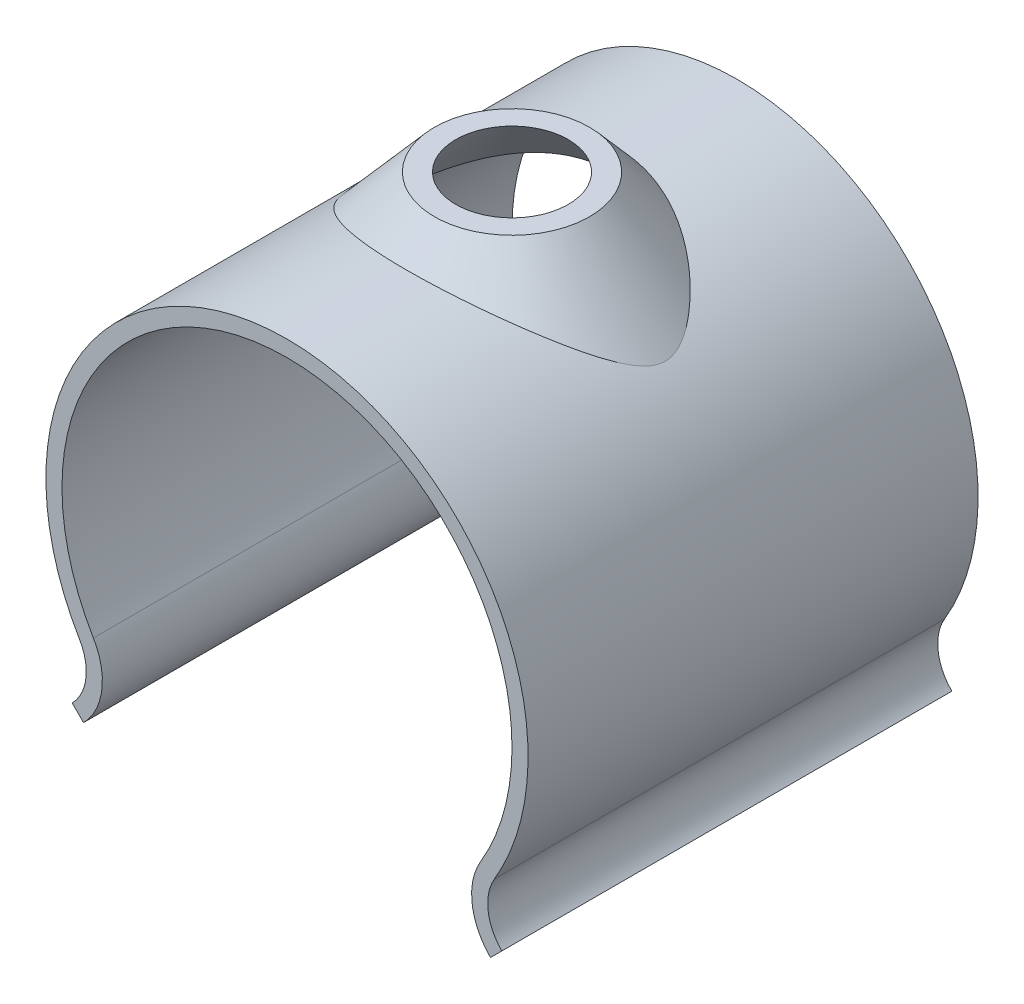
from build123d import *

# Parameters (mm, degrees)
EXTRUDE_1_DEPTH     = 11.1125
SKETCH_3_R          = 11.1125
CUT_EXTRUDE_1_DEPTH = 29.597040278


with BuildPart() as part:
    # Sketch 1 → Extrude 1 (new, symmetric)
    with BuildSketch(Plane.XY):
        with BuildLine():
            Line((-10.04864121, -9.525), (-10.609907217, -8.963733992))
            ThreePointArc((-10.609907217, -8.963733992), (-9.931147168, -7.577712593), (-10.244754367, -6.066613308))
            ThreePointArc((-10.244754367, -6.066613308), (0, 11.90625), (10.244754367, -6.066613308))
            ThreePointArc((10.244754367, -6.066613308), (9.931147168, -7.577712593), (10.609907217, -8.963733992))
            Line((10.609907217, -8.963733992), (10.04864121, -9.525))
            ThreePointArc((10.04864121, -9.525), (9.14362781, -7.676971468), (9.561770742, -5.662172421))
            ThreePointArc((9.561770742, -5.662172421), (0, 11.1125), (-9.561770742, -5.662172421))
            ThreePointArc((-9.561770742, -5.662172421), (-9.14362781, -7.676971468), (-10.04864121, -9.525))
        make_face()
    extrude(amount=EXTRUDE_1_DEPTH, both=True)

    # Sketch 2 → Revolve 1 (revolve)
    with BuildSketch(Plane.XY, mode=Mode.PRIVATE) as revolve_1_sk:
        Polygon((0, 9.186534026), (0, 13.49375), (-3.829854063, 13.49375), (-7.574059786, 9.186534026), align=None)
    revolve(revolve_1_sk.sketch.rotate(Axis((0, 0, 0), (0, 1, 0)), 270), axis=Axis((0, 0, 0), (0, 1, 0)))

    # Sketch 3 → Cut-Extrude 1 (cut, through all)
    with BuildSketch(Plane.XY.offset(11.1125)):
        Circle(SKETCH_3_R)
    extrude(amount=-CUT_EXTRUDE_1_DEPTH, mode=Mode.SUBTRACT)

    # Sketch 4 → Cut-Revolve 1 (revolve, cut)
    with BuildSketch(Plane.XY, mode=Mode.PRIVATE) as cut_revolve_1_sk:
        Polygon((0, 8.615170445), (-7.019009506, 8.615170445), (-2.778125, 13.49375), (0, 13.49375), align=None)
    revolve(cut_revolve_1_sk.sketch.rotate(Axis((0, 0, 0), (0, 1, 0)), 270), axis=Axis((0, 0, 0), (0, 1, 0)), mode=Mode.SUBTRACT)


solid = part.part
